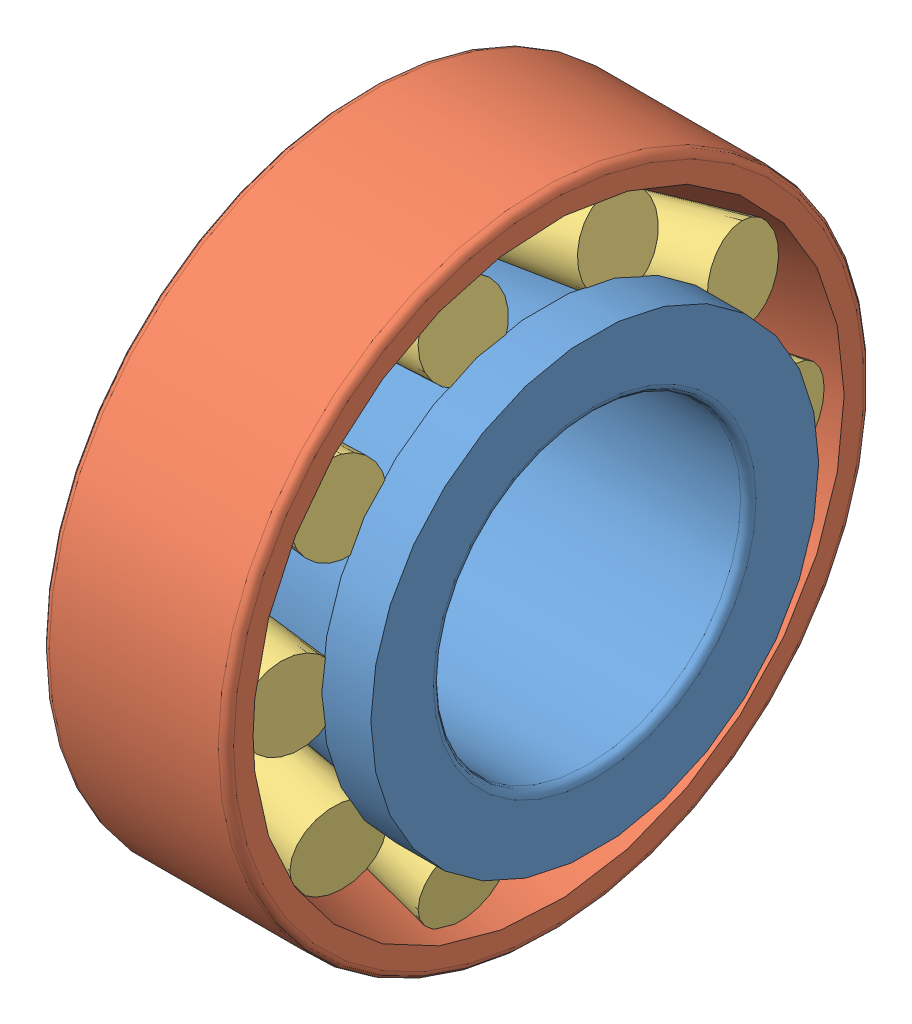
SolidWorks assembly Roulement_conique 32004X 20x42x15.SLDASM, configuration Défaut (file format 3100). Lengths in mm.
Overall size (15 42 42).
12 component instances, 3 part files, 4 mates.
Components (placement in the parent):
- Roulement_conique 32004X 20x42x15_Bint3-1: Roulement_conique 32004X 20x42x15_Bint3.SLDPRT [Défaut] at origin size (15 29.14 29.14)
- Roulement_conique 32004X 20x42x15_Bext3-1: Roulement_conique 32004X 20x42x15_Bext3.SLDPRT [Défaut] at origin size (12 42 42)
- Roulement_conique 32004X 20x42x15_Eroul3-1: Roulement_conique 32004X 20x42x15_Eroul3.SLDPRT [Défaut] at (7.5 0 -15.5) size (11.14 5.5 6.84)
- Roulement_conique 32004X 20x42x15_Eroul3-2: Roulement_conique 32004X 20x42x15_Eroul3.SLDPRT [Défaut] at (7.5 9.1107 -12.5398) x (1 0 0) z (0 -0.587785 0.809017) size (11.14 5.5 6.84)
- Roulement_conique 32004X 20x42x15_Eroul3-3: Roulement_conique 32004X 20x42x15_Eroul3.SLDPRT [Défaut] at (7.5 14.7414 -4.7898) x (1 0 0) z (0 -0.951057 0.309017) size (11.14 5.5 6.84)
- Roulement_conique 32004X 20x42x15_Eroul3-4: Roulement_conique 32004X 20x42x15_Eroul3.SLDPRT [Défaut] at (7.5 14.7414 4.7898) x (1 0 0) z (0 -0.951057 -0.309017) size (11.14 5.5 6.84)
- Roulement_conique 32004X 20x42x15_Eroul3-5: Roulement_conique 32004X 20x42x15_Eroul3.SLDPRT [Défaut] at (7.5 9.1107 12.5398) x (1 0 0) z (0 -0.587785 -0.809017) size (11.14 5.5 6.84)
- Roulement_conique 32004X 20x42x15_Eroul3-6: Roulement_conique 32004X 20x42x15_Eroul3.SLDPRT [Défaut] at (7.5 0 15.5) x (1 0 0) z (0 0 -1) size (11.14 5.5 6.84)
- Roulement_conique 32004X 20x42x15_Eroul3-7: Roulement_conique 32004X 20x42x15_Eroul3.SLDPRT [Défaut] at (7.5 -9.1107 12.5398) x (1 0 0) z (0 0.587785 -0.809017) size (11.14 5.5 6.84)
- Roulement_conique 32004X 20x42x15_Eroul3-8: Roulement_conique 32004X 20x42x15_Eroul3.SLDPRT [Défaut] at (7.5 -14.7414 4.7898) x (1 0 0) z (0 0.951057 -0.309017) size (11.14 5.5 6.84)
- Roulement_conique 32004X 20x42x15_Eroul3-9: Roulement_conique 32004X 20x42x15_Eroul3.SLDPRT [Défaut] at (7.5 -14.7414 -4.7898) x (1 0 0) z (0 0.951057 0.309017) size (11.14 5.5 6.84)
- Roulement_conique 32004X 20x42x15_Eroul3-10: Roulement_conique 32004X 20x42x15_Eroul3.SLDPRT [Défaut] at (7.5 -9.1107 -12.5398) x (1 0 0) z (0 0.587785 0.809017) size (11.14 5.5 6.84)
Mates (geometry in assembly coordinates):
- Coïncidente1: coincident: point of ?
- Coïncidente2: coincident: unknown of ?
- Coïncidente4: coincident: point of Roulement_conique 32004X 20x42x15_Eroul3-1; point of assembly
- Parallèle1: parallel = 29.4109 mm aligned: plane of ? through (0 0 0) normal (1 0 0); unknown of ?
